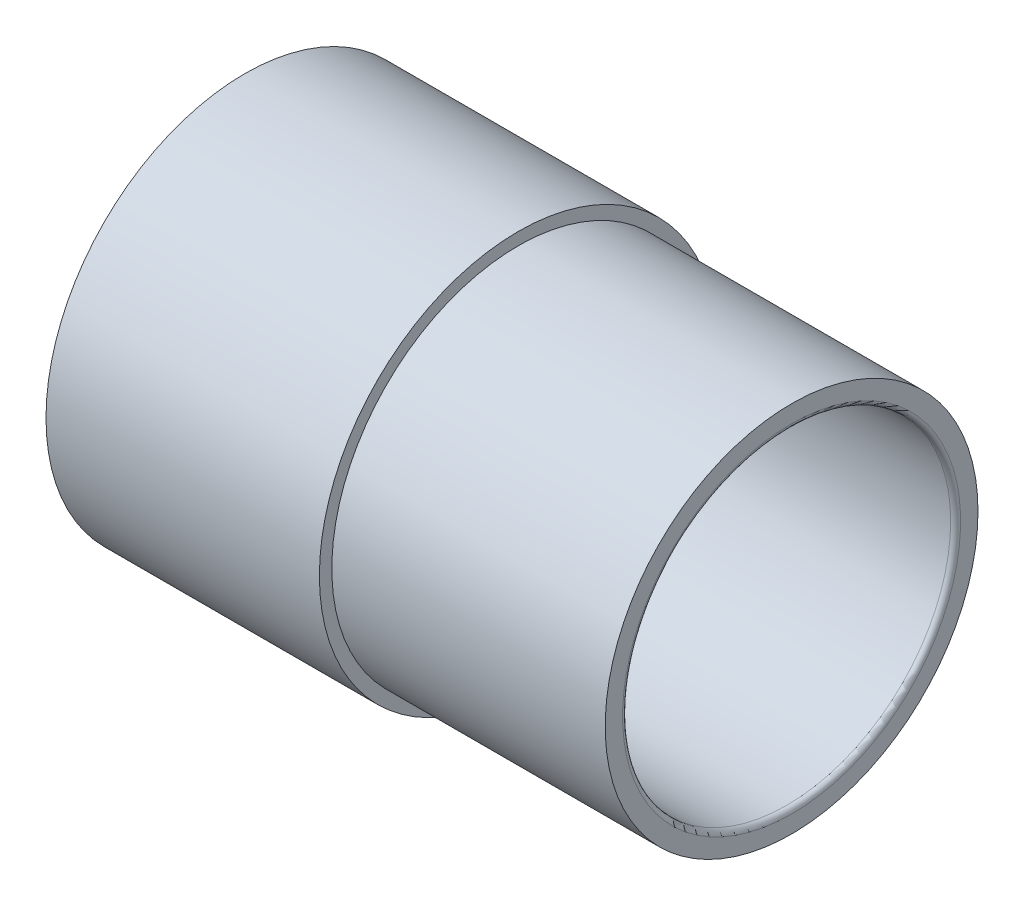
ISO-10303-21;
HEADER;
FILE_DESCRIPTION(('STEP AP214'),'2;1');
FILE_NAME('part.step','',(''),(''),'','','');
FILE_SCHEMA(('AUTOMOTIVE_DESIGN { 1 0 10303 214 1 1 1 1 }'));
ENDSEC;
DATA;
#1=APPLICATION_CONTEXT('core data for automotive mechanical design processes');
#2=APPLICATION_PROTOCOL_DEFINITION('international standard','automotive_design',2000,#1);
#3=PRODUCT_CONTEXT('',#1,'mechanical');
#4=PRODUCT('Part','Part','',(#3));
#5=PRODUCT_RELATED_PRODUCT_CATEGORY('part','',(#4));
#6=PRODUCT_DEFINITION_FORMATION('','',#4);
#7=PRODUCT_DEFINITION_CONTEXT('part definition',#1,'design');
#8=PRODUCT_DEFINITION('design','',#6,#7);
#9=PRODUCT_DEFINITION_SHAPE('','',#8);
#10=(LENGTH_UNIT() NAMED_UNIT(*) SI_UNIT(.MILLI.,.METRE.));
#11=(NAMED_UNIT(*) PLANE_ANGLE_UNIT() SI_UNIT($,.RADIAN.));
#12=(NAMED_UNIT(*) SI_UNIT($,.STERADIAN.) SOLID_ANGLE_UNIT());
#13=UNCERTAINTY_MEASURE_WITH_UNIT(LENGTH_MEASURE(1.E-05),#10,'distance_accuracy_value','');
#14=(GEOMETRIC_REPRESENTATION_CONTEXT(3) GLOBAL_UNCERTAINTY_ASSIGNED_CONTEXT((#13)) GLOBAL_UNIT_ASSIGNED_CONTEXT((#10,
#11,#12)) REPRESENTATION_CONTEXT('',''));
#15=CARTESIAN_POINT('',(0.,0.,0.));
#16=DIRECTION('',(0.,0.,1.));
#17=DIRECTION('',(1.,0.,0.));
#18=AXIS2_PLACEMENT_3D('',#15,#16,#17);
#19=CARTESIAN_POINT('',(82.0736582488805,60.1887254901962,0.));
#20=DIRECTION('',(1.,0.,0.));
#21=DIRECTION('',(0.,0.,-1.));
#22=AXIS2_PLACEMENT_3D('',#19,#20,#21);
#23=PLANE('',#22);
#24=CARTESIAN_POINT('',(82.0736582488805,52.4387254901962,0.));
#25=DIRECTION('',(1.,0.,0.));
#26=DIRECTION('',(0.,0.,-1.));
#27=AXIS2_PLACEMENT_3D('',#24,#25,#26);
#28=CIRCLE('',#27,7.5);
#29=CARTESIAN_POINT('',(82.0736582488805,52.4387254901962,-7.49999999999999));
#30=VERTEX_POINT('',#29);
#31=EDGE_CURVE('E113',#30,#30,#28,.T.);
#32=ORIENTED_EDGE('',*,*,#31,.F.);
#33=EDGE_LOOP('',(#32));
#34=FACE_BOUND('',#33,.T.);
#35=CARTESIAN_POINT('',(82.0736582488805,52.4387254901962,0.));
#36=DIRECTION('',(1.,0.,0.));
#37=DIRECTION('',(0.,0.,-1.));
#38=AXIS2_PLACEMENT_3D('',#35,#36,#37);
#39=CIRCLE('',#38,8.);
#40=CARTESIAN_POINT('',(82.0736582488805,52.4387254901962,-7.99999999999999));
#41=VERTEX_POINT('',#40);
#42=EDGE_CURVE('E111',#41,#41,#39,.F.);
#43=ORIENTED_EDGE('',*,*,#42,.F.);
#44=EDGE_LOOP('',(#43));
#45=FACE_BOUND('',#44,.T.);
#46=ADVANCED_FACE('F17',(#34,#45),#23,.T.);
#47=CARTESIAN_POINT('',(87.5736582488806,52.4387254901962,0.));
#48=DIRECTION('',(1.,0.,0.));
#49=DIRECTION('',(0.,0.,-1.));
#50=AXIS2_PLACEMENT_3D('',#47,#48,#49);
#51=CYLINDRICAL_SURFACE('',#50,7.5);
#52=CARTESIAN_POINT('',(93.0736582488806,52.4387254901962,0.));
#53=DIRECTION('',(1.,0.,0.));
#54=DIRECTION('',(0.,0.,-1.));
#55=AXIS2_PLACEMENT_3D('',#52,#53,#54);
#56=CIRCLE('',#55,7.5);
#57=CARTESIAN_POINT('',(93.0736582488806,52.4387254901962,-7.49999999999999));
#58=VERTEX_POINT('',#57);
#59=EDGE_CURVE('E43',#58,#58,#56,.T.);
#60=ORIENTED_EDGE('',*,*,#59,.F.);
#61=EDGE_LOOP('',(#60));
#62=FACE_BOUND('',#61,.T.);
#63=ORIENTED_EDGE('',*,*,#31,.T.);
#64=EDGE_LOOP('',(#63));
#65=FACE_BOUND('',#64,.T.);
#66=ADVANCED_FACE('F117',(#62,#65),#51,.T.);
#67=CARTESIAN_POINT('',(76.5736582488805,52.4387254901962,0.));
#68=DIRECTION('',(1.,0.,0.));
#69=DIRECTION('',(0.,0.,-1.));
#70=AXIS2_PLACEMENT_3D('',#67,#68,#69);
#71=CYLINDRICAL_SURFACE('',#70,8.);
#72=ORIENTED_EDGE('',*,*,#42,.T.);
#73=EDGE_LOOP('',(#72));
#74=FACE_BOUND('',#73,.T.);
#75=CARTESIAN_POINT('',(71.0736582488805,52.4387254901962,0.));
#76=DIRECTION('',(1.,0.,0.));
#77=DIRECTION('',(0.,0.,-1.));
#78=AXIS2_PLACEMENT_3D('',#75,#76,#77);
#79=CIRCLE('',#78,8.);
#80=CARTESIAN_POINT('',(71.0736582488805,52.4387254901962,-7.99999999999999));
#81=VERTEX_POINT('',#80);
#82=EDGE_CURVE('E42',#81,#81,#79,.T.);
#83=ORIENTED_EDGE('',*,*,#82,.T.);
#84=EDGE_LOOP('',(#83));
#85=FACE_BOUND('',#84,.T.);
#86=ADVANCED_FACE('F64',(#74,#85),#71,.T.);
#87=CARTESIAN_POINT('',(93.0736582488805,59.5887254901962,0.));
#88=DIRECTION('',(1.,0.,0.));
#89=DIRECTION('',(0.,0.,-1.));
#90=AXIS2_PLACEMENT_3D('',#87,#88,#89);
#91=PLANE('',#90);
#92=CARTESIAN_POINT('',(93.0736582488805,52.4387254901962,0.));
#93=DIRECTION('',(1.,0.,0.));
#94=DIRECTION('',(0.,-1.,0.));
#95=AXIS2_PLACEMENT_3D('',#92,#93,#94);
#96=CIRCLE('',#95,6.8);
#97=CARTESIAN_POINT('',(93.0736582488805,45.6387254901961,0.));
#98=VERTEX_POINT('',#97);
#99=CARTESIAN_POINT('',(93.0736582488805,59.2387254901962,0.));
#100=VERTEX_POINT('',#99);
#101=EDGE_CURVE('E40',#98,#100,#96,.T.);
#102=ORIENTED_EDGE('',*,*,#101,.F.);
#103=CARTESIAN_POINT('',(93.0736582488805,52.4387254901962,0.));
#104=DIRECTION('',(1.,0.,0.));
#105=DIRECTION('',(0.,1.,0.));
#106=AXIS2_PLACEMENT_3D('',#103,#104,#105);
#107=CIRCLE('',#106,6.8);
#108=EDGE_CURVE('E34',#98,#100,#107,.F.);
#109=ORIENTED_EDGE('',*,*,#108,.T.);
#110=EDGE_LOOP('',(#102,#109));
#111=FACE_BOUND('',#110,.T.);
#112=ORIENTED_EDGE('',*,*,#59,.T.);
#113=EDGE_LOOP('',(#112));
#114=FACE_BOUND('',#113,.T.);
#115=ADVANCED_FACE('F46',(#111,#114),#91,.T.);
#116=CARTESIAN_POINT('',(71.0736582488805,59.7387254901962,0.));
#117=DIRECTION('',(1.,0.,0.));
#118=DIRECTION('',(0.,0.,-1.));
#119=AXIS2_PLACEMENT_3D('',#116,#117,#118);
#120=PLANE('',#119);
#121=ORIENTED_EDGE('',*,*,#82,.F.);
#122=EDGE_LOOP('',(#121));
#123=FACE_BOUND('',#122,.T.);
#124=CARTESIAN_POINT('',(71.0736582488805,52.4387254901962,0.));
#125=DIRECTION('',(1.,0.,0.));
#126=DIRECTION('',(0.,0.,-1.));
#127=AXIS2_PLACEMENT_3D('',#124,#125,#126);
#128=CIRCLE('',#127,6.6);
#129=CARTESIAN_POINT('',(71.0736582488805,52.4387254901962,-6.59999999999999));
#130=VERTEX_POINT('',#129);
#131=EDGE_CURVE('E27',#130,#130,#128,.T.);
#132=ORIENTED_EDGE('',*,*,#131,.T.);
#133=EDGE_LOOP('',(#132));
#134=FACE_BOUND('',#133,.T.);
#135=ADVANCED_FACE('F63',(#123,#134),#120,.F.);
#136=CARTESIAN_POINT('',(92.8736582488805,52.4387254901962,0.));
#137=DIRECTION('',(1.,0.,0.));
#138=DIRECTION('',(0.,1.,0.));
#139=AXIS2_PLACEMENT_3D('',#136,#137,#138);
#140=TOROIDAL_SURFACE('',#139,6.8,0.199999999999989);
#141=ORIENTED_EDGE('',*,*,#101,.T.);
#142=ORIENTED_EDGE('',*,*,#108,.F.);
#143=EDGE_LOOP('',(#141,#142));
#144=FACE_BOUND('',#143,.T.);
#145=CARTESIAN_POINT('',(92.8736582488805,52.4387254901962,0.));
#146=DIRECTION('',(1.,0.,0.));
#147=DIRECTION('',(0.,0.,-1.));
#148=AXIS2_PLACEMENT_3D('',#145,#146,#147);
#149=CIRCLE('',#148,6.6);
#150=CARTESIAN_POINT('',(92.8736582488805,52.4387254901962,-6.59999999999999));
#151=VERTEX_POINT('',#150);
#152=EDGE_CURVE('E11',#151,#151,#149,.F.);
#153=ORIENTED_EDGE('',*,*,#152,.T.);
#154=EDGE_LOOP('',(#153));
#155=FACE_BOUND('',#154,.T.);
#156=ADVANCED_FACE('F38',(#144,#155),#140,.T.);
#157=CARTESIAN_POINT('',(81.9736582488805,52.4387254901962,0.));
#158=DIRECTION('',(1.,0.,0.));
#159=DIRECTION('',(0.,0.,-1.));
#160=AXIS2_PLACEMENT_3D('',#157,#158,#159);
#161=CYLINDRICAL_SURFACE('',#160,6.6);
#162=ORIENTED_EDGE('',*,*,#131,.F.);
#163=EDGE_LOOP('',(#162));
#164=FACE_BOUND('',#163,.T.);
#165=ORIENTED_EDGE('',*,*,#152,.F.);
#166=EDGE_LOOP('',(#165));
#167=FACE_BOUND('',#166,.T.);
#168=ADVANCED_FACE('F86',(#164,#167),#161,.F.);
#169=CLOSED_SHELL('',(#46,#66,#86,#115,#135,#156,#168));
#170=MANIFOLD_SOLID_BREP('B1',#169);
#171=ADVANCED_BREP_SHAPE_REPRESENTATION('',(#18,#170),#14);
#172=SHAPE_DEFINITION_REPRESENTATION(#9,#171);
ENDSEC;
END-ISO-10303-21;
